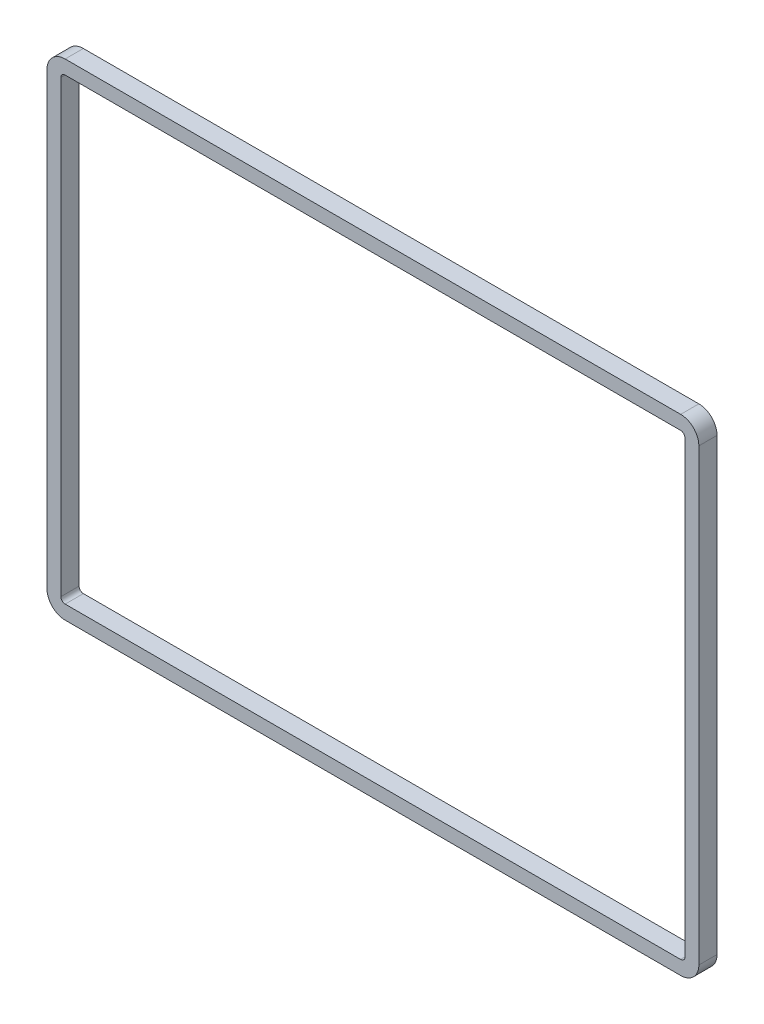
ISO-10303-21;
HEADER;
FILE_DESCRIPTION(('STEP AP214'),'2;1');
FILE_NAME('part.step','',(''),(''),'','','');
FILE_SCHEMA(('AUTOMOTIVE_DESIGN { 1 0 10303 214 1 1 1 1 }'));
ENDSEC;
DATA;
#1=APPLICATION_CONTEXT('core data for automotive mechanical design processes');
#2=APPLICATION_PROTOCOL_DEFINITION('international standard','automotive_design',2000,#1);
#3=PRODUCT_CONTEXT('',#1,'mechanical');
#4=PRODUCT('Part','Part','',(#3));
#5=PRODUCT_RELATED_PRODUCT_CATEGORY('part','',(#4));
#6=PRODUCT_DEFINITION_FORMATION('','',#4);
#7=PRODUCT_DEFINITION_CONTEXT('part definition',#1,'design');
#8=PRODUCT_DEFINITION('design','',#6,#7);
#9=PRODUCT_DEFINITION_SHAPE('','',#8);
#10=(LENGTH_UNIT() NAMED_UNIT(*) SI_UNIT(.MILLI.,.METRE.));
#11=(NAMED_UNIT(*) PLANE_ANGLE_UNIT() SI_UNIT($,.RADIAN.));
#12=(NAMED_UNIT(*) SI_UNIT($,.STERADIAN.) SOLID_ANGLE_UNIT());
#13=UNCERTAINTY_MEASURE_WITH_UNIT(LENGTH_MEASURE(1.E-05),#10,'distance_accuracy_value','');
#14=(GEOMETRIC_REPRESENTATION_CONTEXT(3) GLOBAL_UNCERTAINTY_ASSIGNED_CONTEXT((#13)) GLOBAL_UNIT_ASSIGNED_CONTEXT((#10,
#11,#12)) REPRESENTATION_CONTEXT('',''));
#15=CARTESIAN_POINT('',(0.,0.,0.));
#16=DIRECTION('',(0.,0.,1.));
#17=DIRECTION('',(1.,0.,0.));
#18=AXIS2_PLACEMENT_3D('',#15,#16,#17);
#19=CARTESIAN_POINT('',(3.40740354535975,12.8347236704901,1.7));
#20=DIRECTION('',(0.,0.,-1.));
#21=DIRECTION('',(-1.,0.,0.));
#22=AXIS2_PLACEMENT_3D('',#19,#20,#21);
#23=PLANE('',#22);
#24=CARTESIAN_POINT('',(3.40740354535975,12.8347236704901,1.7));
#25=DIRECTION('',(0.,0.,1.));
#26=DIRECTION('',(-1.,0.,0.));
#27=AXIS2_PLACEMENT_3D('',#24,#25,#26);
#28=CIRCLE('',#27,1.7);
#29=CARTESIAN_POINT('',(5.10740354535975,12.8347236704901,1.7));
#30=VERTEX_POINT('',#29);
#31=CARTESIAN_POINT('',(3.40740354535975,14.5347236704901,1.7));
#32=VERTEX_POINT('',#31);
#33=EDGE_CURVE('E228',#30,#32,#28,.T.);
#34=ORIENTED_EDGE('',*,*,#33,.T.);
#35=DIRECTION('',(-1.,0.,0.));
#36=VECTOR('',#35,1.);
#37=CARTESIAN_POINT('',(-54.0925964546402,14.5347236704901,1.7));
#38=LINE('',#37,#36);
#39=CARTESIAN_POINT('',(-54.0925964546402,14.5347236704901,1.7));
#40=VERTEX_POINT('',#39);
#41=EDGE_CURVE('E231',#32,#40,#38,.T.);
#42=ORIENTED_EDGE('',*,*,#41,.T.);
#43=CARTESIAN_POINT('',(-54.0925964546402,12.8347236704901,1.7));
#44=DIRECTION('',(0.,0.,1.));
#45=DIRECTION('',(-1.,0.,0.));
#46=AXIS2_PLACEMENT_3D('',#43,#44,#45);
#47=CIRCLE('',#46,1.7);
#48=CARTESIAN_POINT('',(-55.7925964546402,12.8347236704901,1.7));
#49=VERTEX_POINT('',#48);
#50=EDGE_CURVE('E233',#40,#49,#47,.T.);
#51=ORIENTED_EDGE('',*,*,#50,.T.);
#52=DIRECTION('',(0.,-1.,0.));
#53=VECTOR('',#52,1.);
#54=CARTESIAN_POINT('',(-55.7925964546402,-29.1652763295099,1.7));
#55=LINE('',#54,#53);
#56=CARTESIAN_POINT('',(-55.7925964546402,-29.1652763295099,1.7));
#57=VERTEX_POINT('',#56);
#58=EDGE_CURVE('E235',#49,#57,#55,.T.);
#59=ORIENTED_EDGE('',*,*,#58,.T.);
#60=CARTESIAN_POINT('',(-54.0925964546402,-29.1652763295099,1.7));
#61=DIRECTION('',(0.,0.,1.));
#62=DIRECTION('',(-1.,0.,0.));
#63=AXIS2_PLACEMENT_3D('',#60,#61,#62);
#64=CIRCLE('',#63,1.7);
#65=CARTESIAN_POINT('',(-54.0925964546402,-30.8652763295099,1.7));
#66=VERTEX_POINT('',#65);
#67=EDGE_CURVE('E237',#57,#66,#64,.T.);
#68=ORIENTED_EDGE('',*,*,#67,.T.);
#69=DIRECTION('',(1.,0.,0.));
#70=VECTOR('',#69,1.);
#71=CARTESIAN_POINT('',(-54.0925964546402,-30.8652763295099,1.7));
#72=LINE('',#71,#70);
#73=CARTESIAN_POINT('',(3.40740354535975,-30.8652763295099,1.7));
#74=VERTEX_POINT('',#73);
#75=EDGE_CURVE('E239',#66,#74,#72,.T.);
#76=ORIENTED_EDGE('',*,*,#75,.T.);
#77=CARTESIAN_POINT('',(3.40740354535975,-29.1652763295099,1.7));
#78=DIRECTION('',(0.,0.,1.));
#79=DIRECTION('',(1.,0.,0.));
#80=AXIS2_PLACEMENT_3D('',#77,#78,#79);
#81=CIRCLE('',#80,1.7);
#82=CARTESIAN_POINT('',(5.10740354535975,-29.1652763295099,1.7));
#83=VERTEX_POINT('',#82);
#84=EDGE_CURVE('E241',#74,#83,#81,.T.);
#85=ORIENTED_EDGE('',*,*,#84,.T.);
#86=DIRECTION('',(0.,1.,0.));
#87=VECTOR('',#86,1.);
#88=CARTESIAN_POINT('',(5.10740354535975,-29.1652763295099,1.7));
#89=LINE('',#88,#87);
#90=EDGE_CURVE('E243',#83,#30,#89,.T.);
#91=ORIENTED_EDGE('',*,*,#90,.T.);
#92=EDGE_LOOP('',(#34,#42,#51,#59,#68,#76,#85,#91));
#93=FACE_BOUND('',#92,.T.);
#94=CARTESIAN_POINT('',(-54.0925964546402,12.8347236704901,1.7));
#95=DIRECTION('',(0.,0.,1.));
#96=DIRECTION('',(-1.,0.,0.));
#97=AXIS2_PLACEMENT_3D('',#94,#95,#96);
#98=CIRCLE('',#97,0.399999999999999);
#99=CARTESIAN_POINT('',(-54.0925964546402,13.2347236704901,1.7));
#100=VERTEX_POINT('',#99);
#101=CARTESIAN_POINT('',(-54.4925964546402,12.8347236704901,1.7));
#102=VERTEX_POINT('',#101);
#103=EDGE_CURVE('E163',#100,#102,#98,.T.);
#104=ORIENTED_EDGE('',*,*,#103,.F.);
#105=DIRECTION('',(-1.,0.,0.));
#106=VECTOR('',#105,1.);
#107=CARTESIAN_POINT('',(-54.0925964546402,13.2347236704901,1.7));
#108=LINE('',#107,#106);
#109=CARTESIAN_POINT('',(3.40740354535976,13.2347236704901,1.7));
#110=VERTEX_POINT('',#109);
#111=EDGE_CURVE('E198',#110,#100,#108,.T.);
#112=ORIENTED_EDGE('',*,*,#111,.F.);
#113=CARTESIAN_POINT('',(3.40740354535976,12.8347236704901,1.7));
#114=DIRECTION('',(0.,0.,1.));
#115=DIRECTION('',(-1.,0.,0.));
#116=AXIS2_PLACEMENT_3D('',#113,#114,#115);
#117=CIRCLE('',#116,0.400000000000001);
#118=CARTESIAN_POINT('',(3.80740354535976,12.8347236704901,1.7));
#119=VERTEX_POINT('',#118);
#120=EDGE_CURVE('E196',#119,#110,#117,.T.);
#121=ORIENTED_EDGE('',*,*,#120,.F.);
#122=DIRECTION('',(0.,1.,0.));
#123=VECTOR('',#122,1.);
#124=CARTESIAN_POINT('',(3.80740354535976,-29.1652763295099,1.7));
#125=LINE('',#124,#123);
#126=CARTESIAN_POINT('',(3.80740354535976,-29.1652763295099,1.7));
#127=VERTEX_POINT('',#126);
#128=EDGE_CURVE('E194',#127,#119,#125,.T.);
#129=ORIENTED_EDGE('',*,*,#128,.F.);
#130=CARTESIAN_POINT('',(3.40740354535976,-29.1652763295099,1.7));
#131=DIRECTION('',(0.,0.,1.));
#132=DIRECTION('',(1.,0.,0.));
#133=AXIS2_PLACEMENT_3D('',#130,#131,#132);
#134=CIRCLE('',#133,0.399999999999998);
#135=CARTESIAN_POINT('',(3.40740354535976,-29.5652763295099,1.7));
#136=VERTEX_POINT('',#135);
#137=EDGE_CURVE('E192',#136,#127,#134,.T.);
#138=ORIENTED_EDGE('',*,*,#137,.F.);
#139=DIRECTION('',(1.,0.,0.));
#140=VECTOR('',#139,1.);
#141=CARTESIAN_POINT('',(-54.0925964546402,-29.5652763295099,1.7));
#142=LINE('',#141,#140);
#143=CARTESIAN_POINT('',(-54.0925964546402,-29.5652763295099,1.7));
#144=VERTEX_POINT('',#143);
#145=EDGE_CURVE('E190',#144,#136,#142,.T.);
#146=ORIENTED_EDGE('',*,*,#145,.F.);
#147=CARTESIAN_POINT('',(-54.0925964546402,-29.1652763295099,1.7));
#148=DIRECTION('',(0.,0.,1.));
#149=DIRECTION('',(-1.,0.,0.));
#150=AXIS2_PLACEMENT_3D('',#147,#148,#149);
#151=CIRCLE('',#150,0.399999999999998);
#152=CARTESIAN_POINT('',(-54.4925964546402,-29.1652763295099,1.7));
#153=VERTEX_POINT('',#152);
#154=EDGE_CURVE('E188',#153,#144,#151,.T.);
#155=ORIENTED_EDGE('',*,*,#154,.F.);
#156=DIRECTION('',(0.,-1.,0.));
#157=VECTOR('',#156,1.);
#158=CARTESIAN_POINT('',(-54.4925964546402,-29.1652763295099,1.7));
#159=LINE('',#158,#157);
#160=EDGE_CURVE('E186',#102,#153,#159,.T.);
#161=ORIENTED_EDGE('',*,*,#160,.F.);
#162=EDGE_LOOP('',(#104,#112,#121,#129,#138,#146,#155,#161));
#163=FACE_BOUND('',#162,.T.);
#164=ADVANCED_FACE('F35',(#93,#163),#23,.F.);
#165=CARTESIAN_POINT('',(3.40740354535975,12.8347236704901,0.));
#166=DIRECTION('',(0.,0.,-1.));
#167=DIRECTION('',(-1.,0.,0.));
#168=AXIS2_PLACEMENT_3D('',#165,#166,#167);
#169=PLANE('',#168);
#170=CARTESIAN_POINT('',(3.40740354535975,12.8347236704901,0.));
#171=DIRECTION('',(0.,0.,1.));
#172=DIRECTION('',(-1.,0.,0.));
#173=AXIS2_PLACEMENT_3D('',#170,#171,#172);
#174=CIRCLE('',#173,1.7);
#175=CARTESIAN_POINT('',(5.10740354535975,12.8347236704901,0.));
#176=VERTEX_POINT('',#175);
#177=CARTESIAN_POINT('',(3.40740354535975,14.5347236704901,0.));
#178=VERTEX_POINT('',#177);
#179=EDGE_CURVE('E164',#176,#178,#174,.T.);
#180=ORIENTED_EDGE('',*,*,#179,.F.);
#181=DIRECTION('',(0.,1.,0.));
#182=VECTOR('',#181,1.);
#183=CARTESIAN_POINT('',(5.10740354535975,-29.1652763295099,0.));
#184=LINE('',#183,#182);
#185=CARTESIAN_POINT('',(5.10740354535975,-29.1652763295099,0.));
#186=VERTEX_POINT('',#185);
#187=EDGE_CURVE('E226',#186,#176,#184,.T.);
#188=ORIENTED_EDGE('',*,*,#187,.F.);
#189=CARTESIAN_POINT('',(3.40740354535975,-29.1652763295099,0.));
#190=DIRECTION('',(0.,0.,1.));
#191=DIRECTION('',(1.,0.,0.));
#192=AXIS2_PLACEMENT_3D('',#189,#190,#191);
#193=CIRCLE('',#192,1.7);
#194=CARTESIAN_POINT('',(3.40740354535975,-30.8652763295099,0.));
#195=VERTEX_POINT('',#194);
#196=EDGE_CURVE('E224',#195,#186,#193,.T.);
#197=ORIENTED_EDGE('',*,*,#196,.F.);
#198=DIRECTION('',(1.,0.,0.));
#199=VECTOR('',#198,1.);
#200=CARTESIAN_POINT('',(-54.0925964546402,-30.8652763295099,0.));
#201=LINE('',#200,#199);
#202=CARTESIAN_POINT('',(-54.0925964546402,-30.8652763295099,0.));
#203=VERTEX_POINT('',#202);
#204=EDGE_CURVE('E222',#203,#195,#201,.T.);
#205=ORIENTED_EDGE('',*,*,#204,.F.);
#206=CARTESIAN_POINT('',(-54.0925964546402,-29.1652763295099,0.));
#207=DIRECTION('',(0.,0.,1.));
#208=DIRECTION('',(-1.,0.,0.));
#209=AXIS2_PLACEMENT_3D('',#206,#207,#208);
#210=CIRCLE('',#209,1.7);
#211=CARTESIAN_POINT('',(-55.7925964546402,-29.1652763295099,0.));
#212=VERTEX_POINT('',#211);
#213=EDGE_CURVE('E220',#212,#203,#210,.T.);
#214=ORIENTED_EDGE('',*,*,#213,.F.);
#215=DIRECTION('',(0.,-1.,0.));
#216=VECTOR('',#215,1.);
#217=CARTESIAN_POINT('',(-55.7925964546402,-29.1652763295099,0.));
#218=LINE('',#217,#216);
#219=CARTESIAN_POINT('',(-55.7925964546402,12.8347236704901,0.));
#220=VERTEX_POINT('',#219);
#221=EDGE_CURVE('E218',#220,#212,#218,.T.);
#222=ORIENTED_EDGE('',*,*,#221,.F.);
#223=CARTESIAN_POINT('',(-54.0925964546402,12.8347236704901,0.));
#224=DIRECTION('',(0.,0.,1.));
#225=DIRECTION('',(-1.,0.,0.));
#226=AXIS2_PLACEMENT_3D('',#223,#224,#225);
#227=CIRCLE('',#226,1.7);
#228=CARTESIAN_POINT('',(-54.0925964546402,14.5347236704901,0.));
#229=VERTEX_POINT('',#228);
#230=EDGE_CURVE('E216',#229,#220,#227,.T.);
#231=ORIENTED_EDGE('',*,*,#230,.F.);
#232=DIRECTION('',(-1.,0.,0.));
#233=VECTOR('',#232,1.);
#234=CARTESIAN_POINT('',(-54.0925964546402,14.5347236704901,0.));
#235=LINE('',#234,#233);
#236=EDGE_CURVE('E214',#178,#229,#235,.T.);
#237=ORIENTED_EDGE('',*,*,#236,.F.);
#238=EDGE_LOOP('',(#180,#188,#197,#205,#214,#222,#231,#237));
#239=FACE_BOUND('',#238,.T.);
#240=DIRECTION('',(-1.,0.,0.));
#241=VECTOR('',#240,1.);
#242=CARTESIAN_POINT('',(-54.0925964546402,13.2347236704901,0.));
#243=LINE('',#242,#241);
#244=CARTESIAN_POINT('',(3.40740354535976,13.2347236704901,0.));
#245=VERTEX_POINT('',#244);
#246=CARTESIAN_POINT('',(-54.0925964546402,13.2347236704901,0.));
#247=VERTEX_POINT('',#246);
#248=EDGE_CURVE('E169',#245,#247,#243,.T.);
#249=ORIENTED_EDGE('',*,*,#248,.T.);
#250=CARTESIAN_POINT('',(-54.0925964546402,12.8347236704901,0.));
#251=DIRECTION('',(0.,0.,1.));
#252=DIRECTION('',(-1.,0.,0.));
#253=AXIS2_PLACEMENT_3D('',#250,#251,#252);
#254=CIRCLE('',#253,0.399999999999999);
#255=CARTESIAN_POINT('',(-54.4925964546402,12.8347236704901,0.));
#256=VERTEX_POINT('',#255);
#257=EDGE_CURVE('E58',#247,#256,#254,.T.);
#258=ORIENTED_EDGE('',*,*,#257,.T.);
#259=DIRECTION('',(0.,-1.,0.));
#260=VECTOR('',#259,1.);
#261=CARTESIAN_POINT('',(-54.4925964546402,-29.1652763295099,0.));
#262=LINE('',#261,#260);
#263=CARTESIAN_POINT('',(-54.4925964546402,-29.1652763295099,0.));
#264=VERTEX_POINT('',#263);
#265=EDGE_CURVE('E150',#256,#264,#262,.T.);
#266=ORIENTED_EDGE('',*,*,#265,.T.);
#267=CARTESIAN_POINT('',(-54.0925964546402,-29.1652763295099,0.));
#268=DIRECTION('',(0.,0.,1.));
#269=DIRECTION('',(-1.,0.,0.));
#270=AXIS2_PLACEMENT_3D('',#267,#268,#269);
#271=CIRCLE('',#270,0.399999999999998);
#272=CARTESIAN_POINT('',(-54.0925964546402,-29.5652763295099,0.));
#273=VERTEX_POINT('',#272);
#274=EDGE_CURVE('E159',#264,#273,#271,.T.);
#275=ORIENTED_EDGE('',*,*,#274,.T.);
#276=DIRECTION('',(1.,0.,0.));
#277=VECTOR('',#276,1.);
#278=CARTESIAN_POINT('',(-54.0925964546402,-29.5652763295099,0.));
#279=LINE('',#278,#277);
#280=CARTESIAN_POINT('',(3.40740354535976,-29.5652763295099,0.));
#281=VERTEX_POINT('',#280);
#282=EDGE_CURVE('E173',#273,#281,#279,.T.);
#283=ORIENTED_EDGE('',*,*,#282,.T.);
#284=CARTESIAN_POINT('',(3.40740354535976,-29.1652763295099,0.));
#285=DIRECTION('',(0.,0.,1.));
#286=DIRECTION('',(1.,0.,0.));
#287=AXIS2_PLACEMENT_3D('',#284,#285,#286);
#288=CIRCLE('',#287,0.399999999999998);
#289=CARTESIAN_POINT('',(3.80740354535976,-29.1652763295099,0.));
#290=VERTEX_POINT('',#289);
#291=EDGE_CURVE('E176',#281,#290,#288,.T.);
#292=ORIENTED_EDGE('',*,*,#291,.T.);
#293=DIRECTION('',(0.,1.,0.));
#294=VECTOR('',#293,1.);
#295=CARTESIAN_POINT('',(3.80740354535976,-29.1652763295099,0.));
#296=LINE('',#295,#294);
#297=CARTESIAN_POINT('',(3.80740354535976,12.8347236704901,0.));
#298=VERTEX_POINT('',#297);
#299=EDGE_CURVE('E179',#290,#298,#296,.T.);
#300=ORIENTED_EDGE('',*,*,#299,.T.);
#301=CARTESIAN_POINT('',(3.40740354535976,12.8347236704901,0.));
#302=DIRECTION('',(0.,0.,1.));
#303=DIRECTION('',(-1.,0.,0.));
#304=AXIS2_PLACEMENT_3D('',#301,#302,#303);
#305=CIRCLE('',#304,0.400000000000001);
#306=EDGE_CURVE('E182',#298,#245,#305,.T.);
#307=ORIENTED_EDGE('',*,*,#306,.T.);
#308=EDGE_LOOP('',(#249,#258,#266,#275,#283,#292,#300,#307));
#309=FACE_BOUND('',#308,.T.);
#310=ADVANCED_FACE('F167',(#239,#309),#169,.T.);
#311=CARTESIAN_POINT('',(3.40740354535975,12.8347236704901,1.7));
#312=DIRECTION('',(0.,0.,-1.));
#313=DIRECTION('',(-1.,0.,0.));
#314=AXIS2_PLACEMENT_3D('',#311,#312,#313);
#315=CYLINDRICAL_SURFACE('',#314,1.7);
#316=ORIENTED_EDGE('',*,*,#179,.T.);
#317=DIRECTION('',(0.,0.,-1.));
#318=VECTOR('',#317,1.);
#319=CARTESIAN_POINT('',(3.40740354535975,14.5347236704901,1.7));
#320=LINE('',#319,#318);
#321=EDGE_CURVE('E11',#32,#178,#320,.T.);
#322=ORIENTED_EDGE('',*,*,#321,.F.);
#323=ORIENTED_EDGE('',*,*,#33,.F.);
#324=DIRECTION('',(0.,0.,-1.));
#325=VECTOR('',#324,1.);
#326=CARTESIAN_POINT('',(5.10740354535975,12.8347236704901,1.7));
#327=LINE('',#326,#325);
#328=EDGE_CURVE('E245',#30,#176,#327,.T.);
#329=ORIENTED_EDGE('',*,*,#328,.T.);
#330=EDGE_LOOP('',(#316,#322,#323,#329));
#331=FACE_BOUND('',#330,.T.);
#332=ADVANCED_FACE('F37',(#331),#315,.T.);
#333=CARTESIAN_POINT('',(-54.0925964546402,14.5347236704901,1.7));
#334=DIRECTION('',(0.,-1.,0.));
#335=DIRECTION('',(1.,0.,0.));
#336=AXIS2_PLACEMENT_3D('',#333,#334,#335);
#337=PLANE('',#336);
#338=ORIENTED_EDGE('',*,*,#236,.T.);
#339=DIRECTION('',(0.,0.,-1.));
#340=VECTOR('',#339,1.);
#341=CARTESIAN_POINT('',(-54.0925964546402,14.5347236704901,1.7));
#342=LINE('',#341,#340);
#343=EDGE_CURVE('E43',#40,#229,#342,.T.);
#344=ORIENTED_EDGE('',*,*,#343,.F.);
#345=ORIENTED_EDGE('',*,*,#41,.F.);
#346=ORIENTED_EDGE('',*,*,#321,.T.);
#347=EDGE_LOOP('',(#338,#344,#345,#346));
#348=FACE_BOUND('',#347,.T.);
#349=ADVANCED_FACE('F289',(#348),#337,.F.);
#350=CARTESIAN_POINT('',(-54.0925964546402,12.8347236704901,1.7));
#351=DIRECTION('',(0.,0.,-1.));
#352=DIRECTION('',(-1.,0.,0.));
#353=AXIS2_PLACEMENT_3D('',#350,#351,#352);
#354=CYLINDRICAL_SURFACE('',#353,1.7);
#355=ORIENTED_EDGE('',*,*,#230,.T.);
#356=DIRECTION('',(0.,0.,-1.));
#357=VECTOR('',#356,1.);
#358=CARTESIAN_POINT('',(-55.7925964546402,12.8347236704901,1.7));
#359=LINE('',#358,#357);
#360=EDGE_CURVE('E260',#49,#220,#359,.T.);
#361=ORIENTED_EDGE('',*,*,#360,.F.);
#362=ORIENTED_EDGE('',*,*,#50,.F.);
#363=ORIENTED_EDGE('',*,*,#343,.T.);
#364=EDGE_LOOP('',(#355,#361,#362,#363));
#365=FACE_BOUND('',#364,.T.);
#366=ADVANCED_FACE('F267',(#365),#354,.T.);
#367=CARTESIAN_POINT('',(-55.7925964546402,-29.1652763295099,1.7));
#368=DIRECTION('',(1.,0.,0.));
#369=DIRECTION('',(0.,0.,-1.));
#370=AXIS2_PLACEMENT_3D('',#367,#368,#369);
#371=PLANE('',#370);
#372=ORIENTED_EDGE('',*,*,#221,.T.);
#373=DIRECTION('',(0.,0.,-1.));
#374=VECTOR('',#373,1.);
#375=CARTESIAN_POINT('',(-55.7925964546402,-29.1652763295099,1.7));
#376=LINE('',#375,#374);
#377=EDGE_CURVE('E257',#57,#212,#376,.T.);
#378=ORIENTED_EDGE('',*,*,#377,.F.);
#379=ORIENTED_EDGE('',*,*,#58,.F.);
#380=ORIENTED_EDGE('',*,*,#360,.T.);
#381=EDGE_LOOP('',(#372,#378,#379,#380));
#382=FACE_BOUND('',#381,.T.);
#383=ADVANCED_FACE('F277',(#382),#371,.F.);
#384=CARTESIAN_POINT('',(-54.0925964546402,-29.1652763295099,1.7));
#385=DIRECTION('',(0.,0.,-1.));
#386=DIRECTION('',(-1.,0.,0.));
#387=AXIS2_PLACEMENT_3D('',#384,#385,#386);
#388=CYLINDRICAL_SURFACE('',#387,1.7);
#389=ORIENTED_EDGE('',*,*,#213,.T.);
#390=DIRECTION('',(0.,0.,-1.));
#391=VECTOR('',#390,1.);
#392=CARTESIAN_POINT('',(-54.0925964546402,-30.8652763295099,1.7));
#393=LINE('',#392,#391);
#394=EDGE_CURVE('E254',#66,#203,#393,.T.);
#395=ORIENTED_EDGE('',*,*,#394,.F.);
#396=ORIENTED_EDGE('',*,*,#67,.F.);
#397=ORIENTED_EDGE('',*,*,#377,.T.);
#398=EDGE_LOOP('',(#389,#395,#396,#397));
#399=FACE_BOUND('',#398,.T.);
#400=ADVANCED_FACE('F281',(#399),#388,.T.);
#401=CARTESIAN_POINT('',(-54.0925964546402,-30.8652763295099,1.7));
#402=DIRECTION('',(0.,1.,0.));
#403=DIRECTION('',(0.,0.,1.));
#404=AXIS2_PLACEMENT_3D('',#401,#402,#403);
#405=PLANE('',#404);
#406=ORIENTED_EDGE('',*,*,#204,.T.);
#407=DIRECTION('',(0.,0.,-1.));
#408=VECTOR('',#407,1.);
#409=CARTESIAN_POINT('',(3.40740354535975,-30.8652763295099,1.7));
#410=LINE('',#409,#408);
#411=EDGE_CURVE('E251',#74,#195,#410,.T.);
#412=ORIENTED_EDGE('',*,*,#411,.F.);
#413=ORIENTED_EDGE('',*,*,#75,.F.);
#414=ORIENTED_EDGE('',*,*,#394,.T.);
#415=EDGE_LOOP('',(#406,#412,#413,#414));
#416=FACE_BOUND('',#415,.T.);
#417=ADVANCED_FACE('F302',(#416),#405,.F.);
#418=CARTESIAN_POINT('',(3.40740354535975,-29.1652763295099,1.7));
#419=DIRECTION('',(0.,0.,-1.));
#420=DIRECTION('',(-1.,0.,0.));
#421=AXIS2_PLACEMENT_3D('',#418,#419,#420);
#422=CYLINDRICAL_SURFACE('',#421,1.7);
#423=ORIENTED_EDGE('',*,*,#196,.T.);
#424=DIRECTION('',(0.,0.,-1.));
#425=VECTOR('',#424,1.);
#426=CARTESIAN_POINT('',(5.10740354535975,-29.1652763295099,1.7));
#427=LINE('',#426,#425);
#428=EDGE_CURVE('E248',#83,#186,#427,.T.);
#429=ORIENTED_EDGE('',*,*,#428,.F.);
#430=ORIENTED_EDGE('',*,*,#84,.F.);
#431=ORIENTED_EDGE('',*,*,#411,.T.);
#432=EDGE_LOOP('',(#423,#429,#430,#431));
#433=FACE_BOUND('',#432,.T.);
#434=ADVANCED_FACE('F300',(#433),#422,.T.);
#435=CARTESIAN_POINT('',(5.10740354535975,-29.1652763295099,1.7));
#436=DIRECTION('',(-1.,0.,0.));
#437=DIRECTION('',(0.,0.,1.));
#438=AXIS2_PLACEMENT_3D('',#435,#436,#437);
#439=PLANE('',#438);
#440=ORIENTED_EDGE('',*,*,#187,.T.);
#441=ORIENTED_EDGE('',*,*,#328,.F.);
#442=ORIENTED_EDGE('',*,*,#90,.F.);
#443=ORIENTED_EDGE('',*,*,#428,.T.);
#444=EDGE_LOOP('',(#440,#441,#442,#443));
#445=FACE_BOUND('',#444,.T.);
#446=ADVANCED_FACE('F295',(#445),#439,.F.);
#447=CARTESIAN_POINT('',(-54.0925964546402,12.8347236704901,1.7));
#448=DIRECTION('',(0.,0.,-1.));
#449=DIRECTION('',(-1.,0.,0.));
#450=AXIS2_PLACEMENT_3D('',#447,#448,#449);
#451=CYLINDRICAL_SURFACE('',#450,0.399999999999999);
#452=ORIENTED_EDGE('',*,*,#257,.F.);
#453=DIRECTION('',(0.,0.,-1.));
#454=VECTOR('',#453,1.);
#455=CARTESIAN_POINT('',(-54.0925964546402,13.2347236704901,1.7));
#456=LINE('',#455,#454);
#457=EDGE_CURVE('E200',#100,#247,#456,.T.);
#458=ORIENTED_EDGE('',*,*,#457,.F.);
#459=ORIENTED_EDGE('',*,*,#103,.T.);
#460=DIRECTION('',(0.,0.,-1.));
#461=VECTOR('',#460,1.);
#462=CARTESIAN_POINT('',(-54.4925964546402,12.8347236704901,1.7));
#463=LINE('',#462,#461);
#464=EDGE_CURVE('E152',#102,#256,#463,.T.);
#465=ORIENTED_EDGE('',*,*,#464,.T.);
#466=EDGE_LOOP('',(#452,#458,#459,#465));
#467=FACE_BOUND('',#466,.T.);
#468=ADVANCED_FACE('F161',(#467),#451,.F.);
#469=CARTESIAN_POINT('',(-54.4925964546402,-29.1652763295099,1.7));
#470=DIRECTION('',(1.,0.,0.));
#471=DIRECTION('',(0.,0.,-1.));
#472=AXIS2_PLACEMENT_3D('',#469,#470,#471);
#473=PLANE('',#472);
#474=ORIENTED_EDGE('',*,*,#265,.F.);
#475=ORIENTED_EDGE('',*,*,#464,.F.);
#476=ORIENTED_EDGE('',*,*,#160,.T.);
#477=DIRECTION('',(0.,0.,-1.));
#478=VECTOR('',#477,1.);
#479=CARTESIAN_POINT('',(-54.4925964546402,-29.1652763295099,1.7));
#480=LINE('',#479,#478);
#481=EDGE_CURVE('E155',#153,#264,#480,.T.);
#482=ORIENTED_EDGE('',*,*,#481,.T.);
#483=EDGE_LOOP('',(#474,#475,#476,#482));
#484=FACE_BOUND('',#483,.T.);
#485=ADVANCED_FACE('F151',(#484),#473,.T.);
#486=CARTESIAN_POINT('',(-54.0925964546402,-29.1652763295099,1.7));
#487=DIRECTION('',(0.,0.,-1.));
#488=DIRECTION('',(-1.,0.,0.));
#489=AXIS2_PLACEMENT_3D('',#486,#487,#488);
#490=CYLINDRICAL_SURFACE('',#489,0.399999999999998);
#491=ORIENTED_EDGE('',*,*,#274,.F.);
#492=ORIENTED_EDGE('',*,*,#481,.F.);
#493=ORIENTED_EDGE('',*,*,#154,.T.);
#494=DIRECTION('',(0.,0.,-1.));
#495=VECTOR('',#494,1.);
#496=CARTESIAN_POINT('',(-54.0925964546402,-29.5652763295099,1.7));
#497=LINE('',#496,#495);
#498=EDGE_CURVE('E209',#144,#273,#497,.T.);
#499=ORIENTED_EDGE('',*,*,#498,.T.);
#500=EDGE_LOOP('',(#491,#492,#493,#499));
#501=FACE_BOUND('',#500,.T.);
#502=ADVANCED_FACE('F326',(#501),#490,.F.);
#503=CARTESIAN_POINT('',(-54.0925964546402,-29.5652763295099,1.7));
#504=DIRECTION('',(0.,1.,0.));
#505=DIRECTION('',(0.,0.,1.));
#506=AXIS2_PLACEMENT_3D('',#503,#504,#505);
#507=PLANE('',#506);
#508=ORIENTED_EDGE('',*,*,#282,.F.);
#509=ORIENTED_EDGE('',*,*,#498,.F.);
#510=ORIENTED_EDGE('',*,*,#145,.T.);
#511=DIRECTION('',(0.,0.,-1.));
#512=VECTOR('',#511,1.);
#513=CARTESIAN_POINT('',(3.40740354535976,-29.5652763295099,1.7));
#514=LINE('',#513,#512);
#515=EDGE_CURVE('E207',#136,#281,#514,.T.);
#516=ORIENTED_EDGE('',*,*,#515,.T.);
#517=EDGE_LOOP('',(#508,#509,#510,#516));
#518=FACE_BOUND('',#517,.T.);
#519=ADVANCED_FACE('F331',(#518),#507,.T.);
#520=CARTESIAN_POINT('',(3.40740354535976,-29.1652763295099,1.7));
#521=DIRECTION('',(0.,0.,-1.));
#522=DIRECTION('',(-1.,0.,0.));
#523=AXIS2_PLACEMENT_3D('',#520,#521,#522);
#524=CYLINDRICAL_SURFACE('',#523,0.399999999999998);
#525=ORIENTED_EDGE('',*,*,#291,.F.);
#526=ORIENTED_EDGE('',*,*,#515,.F.);
#527=ORIENTED_EDGE('',*,*,#137,.T.);
#528=DIRECTION('',(0.,0.,-1.));
#529=VECTOR('',#528,1.);
#530=CARTESIAN_POINT('',(3.80740354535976,-29.1652763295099,1.7));
#531=LINE('',#530,#529);
#532=EDGE_CURVE('E205',#127,#290,#531,.T.);
#533=ORIENTED_EDGE('',*,*,#532,.T.);
#534=EDGE_LOOP('',(#525,#526,#527,#533));
#535=FACE_BOUND('',#534,.T.);
#536=ADVANCED_FACE('F335',(#535),#524,.F.);
#537=CARTESIAN_POINT('',(3.80740354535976,-29.1652763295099,1.7));
#538=DIRECTION('',(-1.,0.,0.));
#539=DIRECTION('',(0.,0.,1.));
#540=AXIS2_PLACEMENT_3D('',#537,#538,#539);
#541=PLANE('',#540);
#542=ORIENTED_EDGE('',*,*,#299,.F.);
#543=ORIENTED_EDGE('',*,*,#532,.F.);
#544=ORIENTED_EDGE('',*,*,#128,.T.);
#545=DIRECTION('',(0.,0.,-1.));
#546=VECTOR('',#545,1.);
#547=CARTESIAN_POINT('',(3.80740354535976,12.8347236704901,1.7));
#548=LINE('',#547,#546);
#549=EDGE_CURVE('E203',#119,#298,#548,.T.);
#550=ORIENTED_EDGE('',*,*,#549,.T.);
#551=EDGE_LOOP('',(#542,#543,#544,#550));
#552=FACE_BOUND('',#551,.T.);
#553=ADVANCED_FACE('F339',(#552),#541,.T.);
#554=CARTESIAN_POINT('',(3.40740354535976,12.8347236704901,1.7));
#555=DIRECTION('',(0.,0.,-1.));
#556=DIRECTION('',(-1.,0.,0.));
#557=AXIS2_PLACEMENT_3D('',#554,#555,#556);
#558=CYLINDRICAL_SURFACE('',#557,0.400000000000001);
#559=ORIENTED_EDGE('',*,*,#306,.F.);
#560=ORIENTED_EDGE('',*,*,#549,.F.);
#561=ORIENTED_EDGE('',*,*,#120,.T.);
#562=DIRECTION('',(0.,0.,-1.));
#563=VECTOR('',#562,1.);
#564=CARTESIAN_POINT('',(3.40740354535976,13.2347236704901,1.7));
#565=LINE('',#564,#563);
#566=EDGE_CURVE('E50',#110,#245,#565,.T.);
#567=ORIENTED_EDGE('',*,*,#566,.T.);
#568=EDGE_LOOP('',(#559,#560,#561,#567));
#569=FACE_BOUND('',#568,.T.);
#570=ADVANCED_FACE('F343',(#569),#558,.F.);
#571=CARTESIAN_POINT('',(-54.0925964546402,13.2347236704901,1.7));
#572=DIRECTION('',(0.,-1.,0.));
#573=DIRECTION('',(0.,0.,-1.));
#574=AXIS2_PLACEMENT_3D('',#571,#572,#573);
#575=PLANE('',#574);
#576=ORIENTED_EDGE('',*,*,#248,.F.);
#577=ORIENTED_EDGE('',*,*,#566,.F.);
#578=ORIENTED_EDGE('',*,*,#111,.T.);
#579=ORIENTED_EDGE('',*,*,#457,.T.);
#580=EDGE_LOOP('',(#576,#577,#578,#579));
#581=FACE_BOUND('',#580,.T.);
#582=ADVANCED_FACE('F347',(#581),#575,.T.);
#583=CLOSED_SHELL('',(#164,#310,#332,#349,#366,#383,#400,#417,#434,#446,#468,#485,#502,#519,
#536,#553,#570,#582));
#584=MANIFOLD_SOLID_BREP('B2',#583);
#585=ADVANCED_BREP_SHAPE_REPRESENTATION('',(#18,#584),#14);
#586=SHAPE_DEFINITION_REPRESENTATION(#9,#585);
ENDSEC;
END-ISO-10303-21;
